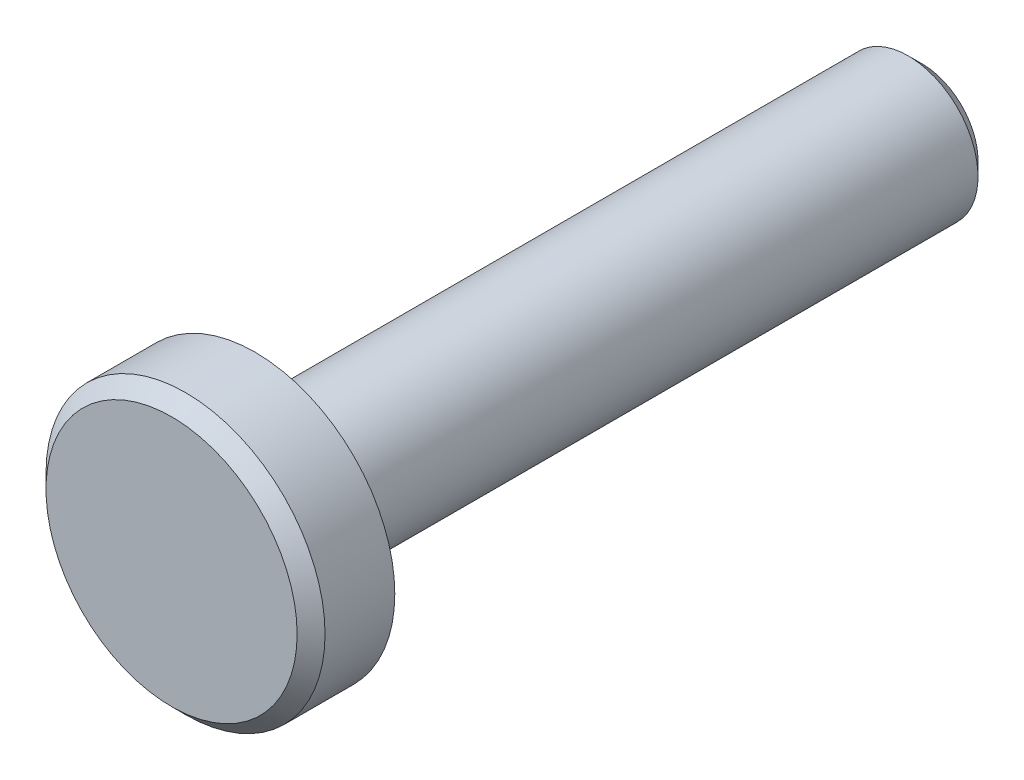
from build123d import *

# Parameters (mm, degrees)
BASE_EXTRUSION_DEPTH      = 5.7
BASE_EXTRUSION_DEPTH_BACK = 6.25
ESQUISSE1_R               = 1.25
ESQUISSE2_R               = 2.5
BOSS_EXTRU_1_DEPTH        = 1.5
CHANFREIN1_SIZE           = 0.25


with BuildPart() as part:
    # Esquisse1 → Base-Extrusion (new, two sides: drawn at the far end of the back side and taken through both)
    with BuildSketch(Plane.XY.offset(-BASE_EXTRUSION_DEPTH_BACK)):
        with Locations(Location((-4.213074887, -17.5, 0), (0, 0, 180))):
            Circle(ESQUISSE1_R)
    extrude(amount=BASE_EXTRUSION_DEPTH + BASE_EXTRUSION_DEPTH_BACK)

    # Esquisse2 → Boss.-Extru.1 (add)
    with BuildSketch(Plane.XY.offset(5.7)):
        with Locations((-4.213074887, -17.5)):
            Circle(ESQUISSE2_R)
    extrude(amount=BOSS_EXTRU_1_DEPTH)

    # Chanfrein1
    chanfrein1_edges = [part.edges().sort_by_distance(p)[0] for p in [
        (-6.713074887, -17.5, 7.2),
        (-2.963074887, -17.5, -6.25),
    ]]
    chamfer(chanfrein1_edges, length=CHANFREIN1_SIZE)


solid = part.part
